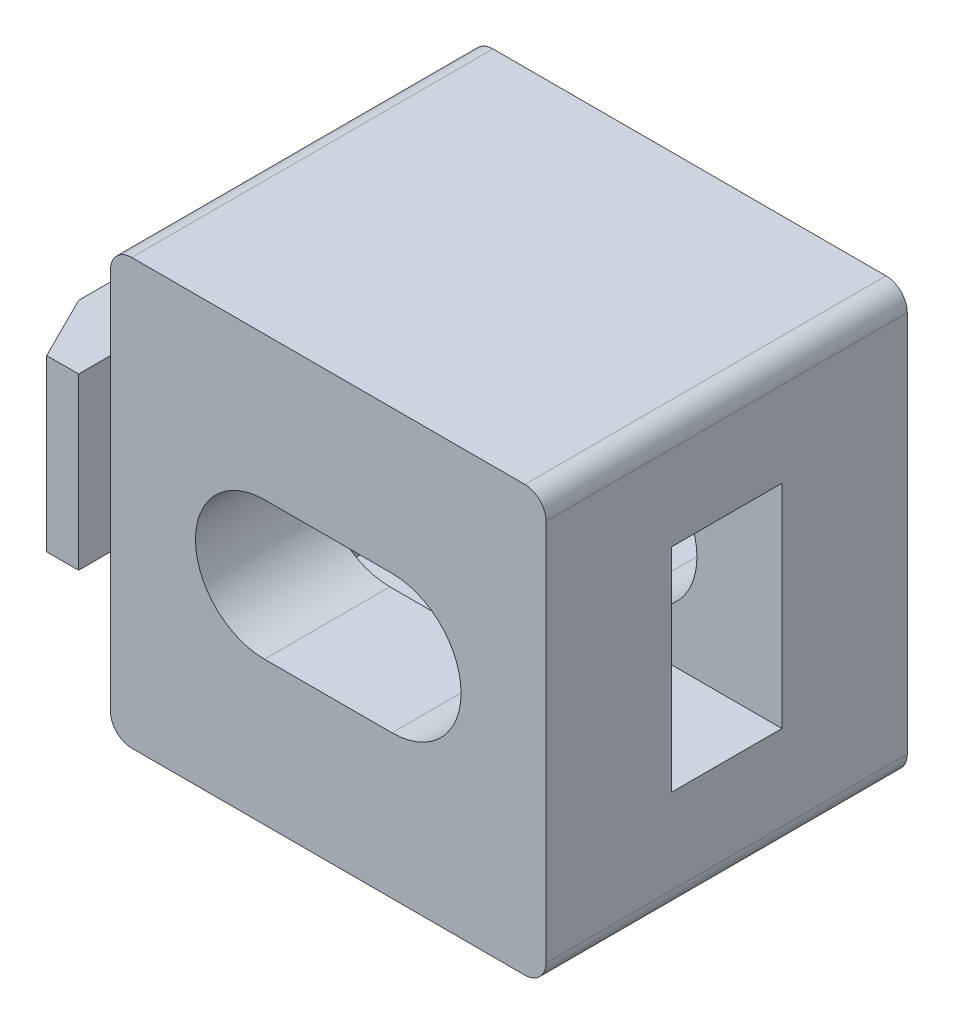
from build123d import *

# Parameters (mm, degrees)
SKETCH_1_W          = 20.5
SKETCH_1_H          = 20
EXTRUDE_1_DEPTH     = 8.5
SKETCH_2_W          = 5.2
SKETCH_2_H          = 10
CUT_EXTRUDE_1_DEPTH = 17
SKETCH_3_W          = 8
SKETCH_3_H          = 8
EXTRUDE_2_DEPTH     = 1.5
FILLET_1_R          = 3
EXTRUDE_3_DEPTH     = 4
FILLET_2_R          = 1


with BuildPart() as part:
    # Sketch 1 → Extrude 1 (new, symmetric)
    with BuildSketch(Plane.XY):
        Rectangle(SKETCH_1_W, SKETCH_1_H)
        with BuildLine():
            Line((-3, 3.25), (3, 3.25))
            ThreePointArc((3, 3.25), (6.25, 0), (3, -3.25))
            Line((3, -3.25), (-3, -3.25))
            ThreePointArc((-3, -3.25), (-6.25, 0), (-3, 3.25))
        make_face(mode=Mode.SUBTRACT)
    extrude(amount=EXTRUDE_1_DEPTH, both=True)

    # Sketch 2 → Cut-Extrude 1 (cut)
    with BuildSketch(Plane(origin=(10.25, 0, 0), x_dir=(0, 0, -1), z_dir=(1, 0, 0))):
        Rectangle(SKETCH_2_W, SKETCH_2_H)
    extrude(amount=-CUT_EXTRUDE_1_DEPTH, mode=Mode.SUBTRACT)

    # Sketch 3 → Extrude 2 (add)
    with BuildSketch(Plane.ZY.offset(10.25)):
        with Locations((1.5, 0)):
            Rectangle(SKETCH_3_W, SKETCH_3_H)
    extrude(amount=EXTRUDE_2_DEPTH)

    # Fillet 1
    fillet_1_edges = [part.edges().sort_by_distance(p)[0] for p in [
        (-11, -4, -2.5),
        (-11, 4, 5.5),
    ]]
    fillet(fillet_1_edges, radius=FILLET_1_R)

    # Sketch 4 → Extrude 3 (add, symmetric)
    with BuildSketch(Plane(origin=(0, 0, 0), x_dir=(1, 0, 0), z_dir=(0, 1, 0))):
        Polygon((-11.75, 2.5), (-11.75, 5.5), (-13.25, 5.5), (-14.75, 2.5), (-14.75, -1.5), (-11.75, -1.5), align=None)
    extrude_3 = extrude(amount=EXTRUDE_3_DEPTH, both=True)

    # Mirror 1: Extrude 3 across plane
    add(extrude_3.mirror(Plane(origin=(-14.75, 4, 1.5), x_dir=(1, 0, 0), z_dir=(0, 0, -1))))

    # Fillet 2
    fillet_2_edges = [part.edges().sort_by_distance(p)[0] for p in [
        (-10.25, 10, 0),
        (10.25, 10, 0),
        (10.25, -10, 0),
        (-10.25, -10, 0),
    ]]
    fillet(fillet_2_edges, radius=FILLET_2_R)


solid = part.part
